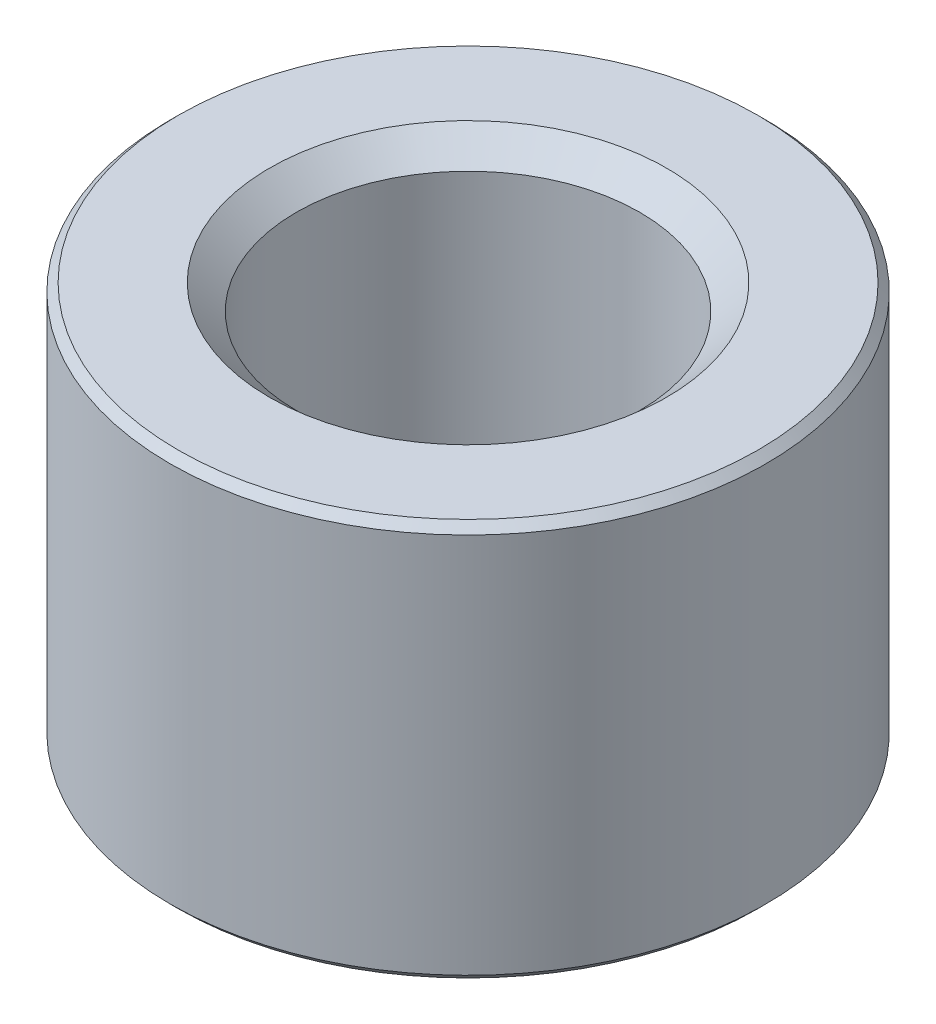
from build123d import *


with BuildPart() as part:
    # Esquisse1 → R_volution1 (revolve)
    with BuildSketch(Plane(origin=(0, 0, 0), x_dir=(-1, 0, 0), z_dir=(0, 0, -1)), mode=Mode.PRIVATE) as r_volution1_sk:
        Polygon((-6, 0), (-5.188125, 0.75), (-5.188125, 11.25), (-6, 12), (-8.76, 12), (-9, 11.76), (-9, 0.24), (-8.76, 0), align=None)
    revolve(r_volution1_sk.sketch.rotate(Axis((0, 0, 0), (0, 1, 0)), 270), axis=Axis((0, 0, 0), (0, 1, 0)))


solid = part.part
